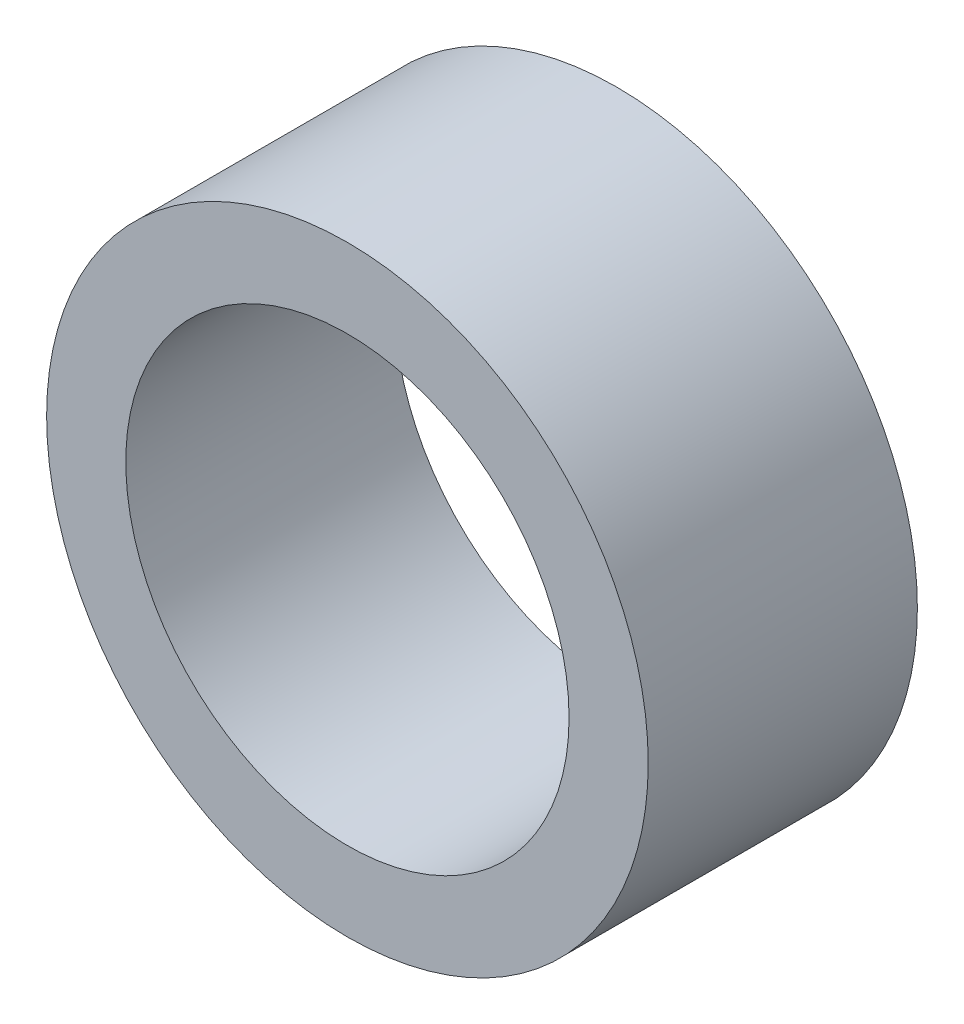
ISO-10303-21;
HEADER;
FILE_DESCRIPTION(('STEP AP214'),'2;1');
FILE_NAME('part.step','',(''),(''),'','','');
FILE_SCHEMA(('AUTOMOTIVE_DESIGN { 1 0 10303 214 1 1 1 1 }'));
ENDSEC;
DATA;
#1=APPLICATION_CONTEXT('core data for automotive mechanical design processes');
#2=APPLICATION_PROTOCOL_DEFINITION('international standard','automotive_design',2000,#1);
#3=PRODUCT_CONTEXT('',#1,'mechanical');
#4=PRODUCT('Part','Part','',(#3));
#5=PRODUCT_RELATED_PRODUCT_CATEGORY('part','',(#4));
#6=PRODUCT_DEFINITION_FORMATION('','',#4);
#7=PRODUCT_DEFINITION_CONTEXT('part definition',#1,'design');
#8=PRODUCT_DEFINITION('design','',#6,#7);
#9=PRODUCT_DEFINITION_SHAPE('','',#8);
#10=(LENGTH_UNIT() NAMED_UNIT(*) SI_UNIT(.MILLI.,.METRE.));
#11=(NAMED_UNIT(*) PLANE_ANGLE_UNIT() SI_UNIT($,.RADIAN.));
#12=(NAMED_UNIT(*) SI_UNIT($,.STERADIAN.) SOLID_ANGLE_UNIT());
#13=UNCERTAINTY_MEASURE_WITH_UNIT(LENGTH_MEASURE(1.E-05),#10,'distance_accuracy_value','');
#14=(GEOMETRIC_REPRESENTATION_CONTEXT(3) GLOBAL_UNCERTAINTY_ASSIGNED_CONTEXT((#13)) GLOBAL_UNIT_ASSIGNED_CONTEXT((#10,
#11,#12)) REPRESENTATION_CONTEXT('',''));
#15=CARTESIAN_POINT('',(0.,0.,0.));
#16=DIRECTION('',(0.,0.,1.));
#17=DIRECTION('',(1.,0.,0.));
#18=AXIS2_PLACEMENT_3D('',#15,#16,#17);
#19=CARTESIAN_POINT('',(0.,0.,17.));
#20=DIRECTION('',(0.,0.,1.));
#21=DIRECTION('',(1.,0.,0.));
#22=AXIS2_PLACEMENT_3D('',#19,#20,#21);
#23=PLANE('',#22);
#24=CARTESIAN_POINT('',(0.,0.,17.));
#25=DIRECTION('',(0.,0.,1.));
#26=DIRECTION('',(1.,0.,0.));
#27=AXIS2_PLACEMENT_3D('',#24,#25,#26);
#28=CIRCLE('',#27,19.);
#29=CARTESIAN_POINT('',(19.,0.,17.));
#30=VERTEX_POINT('',#29);
#31=EDGE_CURVE('E10',#30,#30,#28,.T.);
#32=ORIENTED_EDGE('',*,*,#31,.T.);
#33=EDGE_LOOP('',(#32));
#34=FACE_BOUND('',#33,.T.);
#35=CARTESIAN_POINT('',(0.,0.,17.));
#36=DIRECTION('',(0.,0.,1.));
#37=DIRECTION('',(1.,0.,0.));
#38=AXIS2_PLACEMENT_3D('',#35,#36,#37);
#39=CIRCLE('',#38,14.);
#40=CARTESIAN_POINT('',(14.,0.,17.));
#41=VERTEX_POINT('',#40);
#42=EDGE_CURVE('E41',#41,#41,#39,.T.);
#43=ORIENTED_EDGE('',*,*,#42,.F.);
#44=EDGE_LOOP('',(#43));
#45=FACE_BOUND('',#44,.T.);
#46=ADVANCED_FACE('F30',(#34,#45),#23,.T.);
#47=CARTESIAN_POINT('',(0.,0.,0.));
#48=DIRECTION('',(0.,0.,1.));
#49=DIRECTION('',(1.,0.,0.));
#50=AXIS2_PLACEMENT_3D('',#47,#48,#49);
#51=PLANE('',#50);
#52=CARTESIAN_POINT('',(0.,0.,0.));
#53=DIRECTION('',(0.,0.,1.));
#54=DIRECTION('',(1.,0.,0.));
#55=AXIS2_PLACEMENT_3D('',#52,#53,#54);
#56=CIRCLE('',#55,19.);
#57=CARTESIAN_POINT('',(19.,0.,0.));
#58=VERTEX_POINT('',#57);
#59=EDGE_CURVE('E34',#58,#58,#56,.T.);
#60=ORIENTED_EDGE('',*,*,#59,.F.);
#61=EDGE_LOOP('',(#60));
#62=FACE_BOUND('',#61,.T.);
#63=CARTESIAN_POINT('',(0.,0.,0.));
#64=DIRECTION('',(0.,0.,1.));
#65=DIRECTION('',(1.,0.,0.));
#66=AXIS2_PLACEMENT_3D('',#63,#64,#65);
#67=CIRCLE('',#66,14.);
#68=CARTESIAN_POINT('',(14.,0.,0.));
#69=VERTEX_POINT('',#68);
#70=EDGE_CURVE('E43',#69,#69,#67,.T.);
#71=ORIENTED_EDGE('',*,*,#70,.T.);
#72=EDGE_LOOP('',(#71));
#73=FACE_BOUND('',#72,.T.);
#74=ADVANCED_FACE('F53',(#62,#73),#51,.F.);
#75=CARTESIAN_POINT('',(0.,0.,17.));
#76=DIRECTION('',(0.,0.,-1.));
#77=DIRECTION('',(-1.,0.,0.));
#78=AXIS2_PLACEMENT_3D('',#75,#76,#77);
#79=CYLINDRICAL_SURFACE('',#78,19.);
#80=ORIENTED_EDGE('',*,*,#31,.F.);
#81=EDGE_LOOP('',(#80));
#82=FACE_BOUND('',#81,.T.);
#83=ORIENTED_EDGE('',*,*,#59,.T.);
#84=EDGE_LOOP('',(#83));
#85=FACE_BOUND('',#84,.T.);
#86=ADVANCED_FACE('F32',(#82,#85),#79,.T.);
#87=CARTESIAN_POINT('',(0.,0.,17.));
#88=DIRECTION('',(0.,0.,-1.));
#89=DIRECTION('',(-1.,0.,0.));
#90=AXIS2_PLACEMENT_3D('',#87,#88,#89);
#91=CYLINDRICAL_SURFACE('',#90,14.);
#92=ORIENTED_EDGE('',*,*,#42,.T.);
#93=EDGE_LOOP('',(#92));
#94=FACE_BOUND('',#93,.T.);
#95=ORIENTED_EDGE('',*,*,#70,.F.);
#96=EDGE_LOOP('',(#95));
#97=FACE_BOUND('',#96,.T.);
#98=ADVANCED_FACE('F49',(#94,#97),#91,.F.);
#99=CLOSED_SHELL('',(#46,#74,#86,#98));
#100=MANIFOLD_SOLID_BREP('B2',#99);
#101=ADVANCED_BREP_SHAPE_REPRESENTATION('',(#18,#100),#14);
#102=SHAPE_DEFINITION_REPRESENTATION(#9,#101);
ENDSEC;
END-ISO-10303-21;
